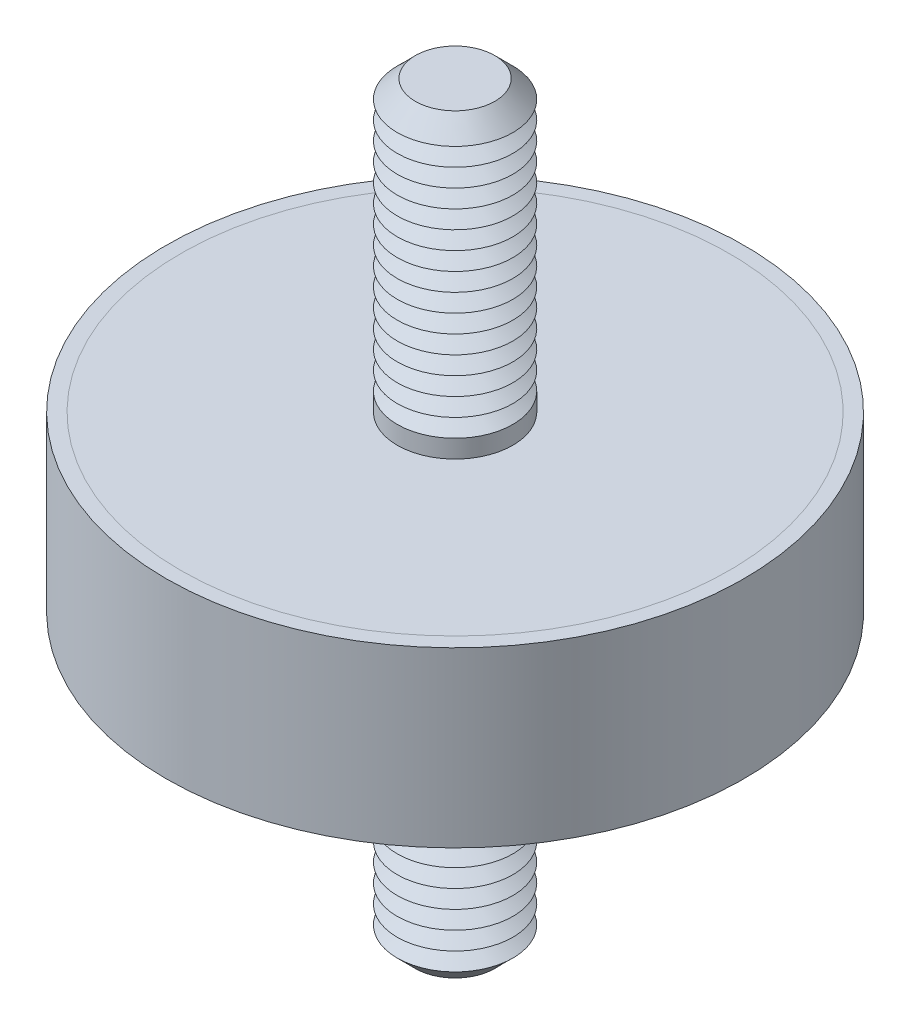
ISO-10303-21;
HEADER;
FILE_DESCRIPTION(('STEP AP214'),'2;1');
FILE_NAME('part.step','',(''),(''),'','','');
FILE_SCHEMA(('AUTOMOTIVE_DESIGN { 1 0 10303 214 1 1 1 1 }'));
ENDSEC;
DATA;
#1=APPLICATION_CONTEXT('core data for automotive mechanical design processes');
#2=APPLICATION_PROTOCOL_DEFINITION('international standard','automotive_design',2000,#1);
#3=PRODUCT_CONTEXT('',#1,'mechanical');
#4=PRODUCT('Part','Part','',(#3));
#5=PRODUCT_RELATED_PRODUCT_CATEGORY('part','',(#4));
#6=PRODUCT_DEFINITION_FORMATION('','',#4);
#7=PRODUCT_DEFINITION_CONTEXT('part definition',#1,'design');
#8=PRODUCT_DEFINITION('design','',#6,#7);
#9=PRODUCT_DEFINITION_SHAPE('','',#8);
#10=(LENGTH_UNIT() NAMED_UNIT(*) SI_UNIT(.MILLI.,.METRE.));
#11=(NAMED_UNIT(*) PLANE_ANGLE_UNIT() SI_UNIT($,.RADIAN.));
#12=(NAMED_UNIT(*) SI_UNIT($,.STERADIAN.) SOLID_ANGLE_UNIT());
#13=UNCERTAINTY_MEASURE_WITH_UNIT(LENGTH_MEASURE(1.E-05),#10,'distance_accuracy_value','');
#14=(GEOMETRIC_REPRESENTATION_CONTEXT(3) GLOBAL_UNCERTAINTY_ASSIGNED_CONTEXT((#13)) GLOBAL_UNIT_ASSIGNED_CONTEXT((#10,
#11,#12)) REPRESENTATION_CONTEXT('',''));
#15=CARTESIAN_POINT('',(0.,0.,0.));
#16=DIRECTION('',(0.,0.,1.));
#17=DIRECTION('',(1.,0.,0.));
#18=AXIS2_PLACEMENT_3D('',#15,#16,#17);
#19=CARTESIAN_POINT('',(0.,-26.,0.));
#20=DIRECTION('',(0.,1.,0.));
#21=DIRECTION('',(0.,0.,1.));
#22=AXIS2_PLACEMENT_3D('',#19,#20,#21);
#23=CYLINDRICAL_SURFACE('',#22,4.);
#24=CARTESIAN_POINT('',(0.,-6.,0.));
#25=DIRECTION('',(0.,-1.,0.));
#26=DIRECTION('',(0.,0.,-1.));
#27=AXIS2_PLACEMENT_3D('',#24,#25,#26);
#28=CIRCLE('',#27,4.);
#29=CARTESIAN_POINT('',(0.,-6.,-4.));
#30=VERTEX_POINT('',#29);
#31=EDGE_CURVE('P0_E21',#30,#30,#28,.T.);
#32=ORIENTED_EDGE('',*,*,#31,.T.);
#33=EDGE_LOOP('',(#32));
#34=FACE_BOUND('',#33,.T.);
#35=CARTESIAN_POINT('',(0.,-7.25,0.));
#36=DIRECTION('',(0.,1.,0.));
#37=DIRECTION('',(0.,0.,1.));
#38=AXIS2_PLACEMENT_3D('',#35,#36,#37);
#39=CIRCLE('',#38,4.);
#40=CARTESIAN_POINT('',(0.,-7.25,4.));
#41=VERTEX_POINT('',#40);
#42=EDGE_CURVE('P0_E33',#41,#41,#39,.T.);
#43=ORIENTED_EDGE('',*,*,#42,.T.);
#44=EDGE_LOOP('',(#43));
#45=FACE_BOUND('',#44,.T.);
#46=ADVANCED_FACE('P0_F14',(#34,#45),#23,.T.);
#47=CARTESIAN_POINT('',(0.,-6.,0.));
#48=DIRECTION('',(0.,1.,0.));
#49=DIRECTION('',(0.,0.,1.));
#50=AXIS2_PLACEMENT_3D('',#47,#48,#49);
#51=CYLINDRICAL_SURFACE('',#50,19.);
#52=CARTESIAN_POINT('',(0.,-6.,0.));
#53=DIRECTION('',(0.,1.,0.));
#54=DIRECTION('',(0.,0.,1.));
#55=AXIS2_PLACEMENT_3D('',#52,#53,#54);
#56=CIRCLE('',#55,19.);
#57=CARTESIAN_POINT('',(0.,-6.,19.));
#58=VERTEX_POINT('',#57);
#59=EDGE_CURVE('P0_E25',#58,#58,#56,.T.);
#60=ORIENTED_EDGE('',*,*,#59,.T.);
#61=EDGE_LOOP('',(#60));
#62=FACE_BOUND('',#61,.T.);
#63=CARTESIAN_POINT('',(0.,-5.5,0.));
#64=DIRECTION('',(0.,1.,0.));
#65=DIRECTION('',(0.,0.,1.));
#66=AXIS2_PLACEMENT_3D('',#63,#64,#65);
#67=CIRCLE('',#66,19.);
#68=CARTESIAN_POINT('',(0.,-5.5,19.));
#69=VERTEX_POINT('',#68);
#70=EDGE_CURVE('P0_E30',#69,#69,#67,.T.);
#71=ORIENTED_EDGE('',*,*,#70,.F.);
#72=EDGE_LOOP('',(#71));
#73=FACE_BOUND('',#72,.T.);
#74=ADVANCED_FACE('P0_F145',(#62,#73),#51,.T.);
#75=CARTESIAN_POINT('',(0.,-6.,0.));
#76=DIRECTION('',(0.,1.,0.));
#77=DIRECTION('',(0.,0.,1.));
#78=AXIS2_PLACEMENT_3D('',#75,#76,#77);
#79=PLANE('',#78);
#80=ORIENTED_EDGE('',*,*,#31,.F.);
#81=EDGE_LOOP('',(#80));
#82=FACE_BOUND('',#81,.T.);
#83=ORIENTED_EDGE('',*,*,#59,.F.);
#84=EDGE_LOOP('',(#83));
#85=FACE_BOUND('',#84,.T.);
#86=ADVANCED_FACE('P0_F150',(#82,#85),#79,.F.);
#87=CARTESIAN_POINT('',(0.,-5.5,0.));
#88=DIRECTION('',(0.,1.,0.));
#89=DIRECTION('',(0.,0.,1.));
#90=AXIS2_PLACEMENT_3D('',#87,#88,#89);
#91=PLANE('',#90);
#92=ORIENTED_EDGE('',*,*,#70,.T.);
#93=EDGE_LOOP('',(#92));
#94=FACE_BOUND('',#93,.T.);
#95=ADVANCED_FACE('P0_F156',(#94),#91,.T.);
#96=CARTESIAN_POINT('',(0.,-7.25,0.));
#97=DIRECTION('',(0.,1.,0.));
#98=DIRECTION('',(0.,0.,1.));
#99=AXIS2_PLACEMENT_3D('',#96,#97,#98);
#100=CONICAL_SURFACE('',#99,4.,1.0471975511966);
#101=CARTESIAN_POINT('',(0.,-7.875,0.));
#102=DIRECTION('',(0.,1.,0.));
#103=DIRECTION('',(0.,0.,1.));
#104=AXIS2_PLACEMENT_3D('',#101,#102,#103);
#105=CIRCLE('',#104,2.91746824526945);
#106=CARTESIAN_POINT('',(0.,-7.875,2.91746824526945));
#107=VERTEX_POINT('',#106);
#108=EDGE_CURVE('P0_E39',#107,#107,#105,.T.);
#109=ORIENTED_EDGE('',*,*,#108,.T.);
#110=EDGE_LOOP('',(#109));
#111=FACE_BOUND('',#110,.T.);
#112=ORIENTED_EDGE('',*,*,#42,.F.);
#113=EDGE_LOOP('',(#112));
#114=FACE_BOUND('',#113,.T.);
#115=ADVANCED_FACE('P0_F159',(#111,#114),#100,.T.);
#116=CARTESIAN_POINT('',(0.,-7.875,0.));
#117=DIRECTION('',(0.,-1.,0.));
#118=DIRECTION('',(0.,0.,-1.));
#119=AXIS2_PLACEMENT_3D('',#116,#117,#118);
#120=CONICAL_SURFACE('',#119,2.91746824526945,1.0471975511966);
#121=CARTESIAN_POINT('',(0.,-8.5,0.));
#122=DIRECTION('',(0.,1.,0.));
#123=DIRECTION('',(0.,0.,1.));
#124=AXIS2_PLACEMENT_3D('',#121,#122,#123);
#125=CIRCLE('',#124,4.);
#126=CARTESIAN_POINT('',(0.,-8.5,4.));
#127=VERTEX_POINT('',#126);
#128=EDGE_CURVE('P0_E43',#127,#127,#125,.T.);
#129=ORIENTED_EDGE('',*,*,#128,.T.);
#130=EDGE_LOOP('',(#129));
#131=FACE_BOUND('',#130,.T.);
#132=ORIENTED_EDGE('',*,*,#108,.F.);
#133=EDGE_LOOP('',(#132));
#134=FACE_BOUND('',#133,.T.);
#135=ADVANCED_FACE('P0_F163',(#131,#134),#120,.T.);
#136=CARTESIAN_POINT('',(0.,-8.5,0.));
#137=DIRECTION('',(0.,1.,0.));
#138=DIRECTION('',(0.,0.,1.));
#139=AXIS2_PLACEMENT_3D('',#136,#137,#138);
#140=CONICAL_SURFACE('',#139,4.,1.0471975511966);
#141=CARTESIAN_POINT('',(0.,-9.125,0.));
#142=DIRECTION('',(0.,1.,0.));
#143=DIRECTION('',(0.,0.,1.));
#144=AXIS2_PLACEMENT_3D('',#141,#142,#143);
#145=CIRCLE('',#144,2.91746824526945);
#146=CARTESIAN_POINT('',(0.,-9.125,2.91746824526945));
#147=VERTEX_POINT('',#146);
#148=EDGE_CURVE('P0_E47',#147,#147,#145,.T.);
#149=ORIENTED_EDGE('',*,*,#148,.T.);
#150=EDGE_LOOP('',(#149));
#151=FACE_BOUND('',#150,.T.);
#152=ORIENTED_EDGE('',*,*,#128,.F.);
#153=EDGE_LOOP('',(#152));
#154=FACE_BOUND('',#153,.T.);
#155=ADVANCED_FACE('P0_F167',(#151,#154),#140,.T.);
#156=CARTESIAN_POINT('',(0.,-9.125,0.));
#157=DIRECTION('',(0.,-1.,0.));
#158=DIRECTION('',(0.,0.,-1.));
#159=AXIS2_PLACEMENT_3D('',#156,#157,#158);
#160=CONICAL_SURFACE('',#159,2.91746824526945,1.0471975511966);
#161=CARTESIAN_POINT('',(0.,-9.75,0.));
#162=DIRECTION('',(0.,1.,0.));
#163=DIRECTION('',(0.,0.,1.));
#164=AXIS2_PLACEMENT_3D('',#161,#162,#163);
#165=CIRCLE('',#164,4.);
#166=CARTESIAN_POINT('',(0.,-9.75,4.));
#167=VERTEX_POINT('',#166);
#168=EDGE_CURVE('P0_E52',#167,#167,#165,.T.);
#169=ORIENTED_EDGE('',*,*,#168,.T.);
#170=EDGE_LOOP('',(#169));
#171=FACE_BOUND('',#170,.T.);
#172=ORIENTED_EDGE('',*,*,#148,.F.);
#173=EDGE_LOOP('',(#172));
#174=FACE_BOUND('',#173,.T.);
#175=ADVANCED_FACE('P0_F174',(#171,#174),#160,.T.);
#176=CARTESIAN_POINT('',(0.,-9.75,0.));
#177=DIRECTION('',(0.,1.,0.));
#178=DIRECTION('',(0.,0.,1.));
#179=AXIS2_PLACEMENT_3D('',#176,#177,#178);
#180=CONICAL_SURFACE('',#179,4.,1.0471975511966);
#181=CARTESIAN_POINT('',(0.,-10.375,0.));
#182=DIRECTION('',(0.,1.,0.));
#183=DIRECTION('',(0.,0.,1.));
#184=AXIS2_PLACEMENT_3D('',#181,#182,#183);
#185=CIRCLE('',#184,2.91746824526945);
#186=CARTESIAN_POINT('',(0.,-10.375,2.91746824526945));
#187=VERTEX_POINT('',#186);
#188=EDGE_CURVE('P0_E55',#187,#187,#185,.T.);
#189=ORIENTED_EDGE('',*,*,#188,.T.);
#190=EDGE_LOOP('',(#189));
#191=FACE_BOUND('',#190,.T.);
#192=ORIENTED_EDGE('',*,*,#168,.F.);
#193=EDGE_LOOP('',(#192));
#194=FACE_BOUND('',#193,.T.);
#195=ADVANCED_FACE('P0_F178',(#191,#194),#180,.T.);
#196=CARTESIAN_POINT('',(0.,-10.375,0.));
#197=DIRECTION('',(0.,-1.,0.));
#198=DIRECTION('',(0.,0.,-1.));
#199=AXIS2_PLACEMENT_3D('',#196,#197,#198);
#200=CONICAL_SURFACE('',#199,2.91746824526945,1.0471975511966);
#201=CARTESIAN_POINT('',(0.,-11.,0.));
#202=DIRECTION('',(0.,1.,0.));
#203=DIRECTION('',(0.,0.,1.));
#204=AXIS2_PLACEMENT_3D('',#201,#202,#203);
#205=CIRCLE('',#204,4.);
#206=CARTESIAN_POINT('',(0.,-11.,4.));
#207=VERTEX_POINT('',#206);
#208=EDGE_CURVE('P0_E58',#207,#207,#205,.T.);
#209=ORIENTED_EDGE('',*,*,#208,.T.);
#210=EDGE_LOOP('',(#209));
#211=FACE_BOUND('',#210,.T.);
#212=ORIENTED_EDGE('',*,*,#188,.F.);
#213=EDGE_LOOP('',(#212));
#214=FACE_BOUND('',#213,.T.);
#215=ADVANCED_FACE('P0_F182',(#211,#214),#200,.T.);
#216=CARTESIAN_POINT('',(0.,-11.,0.));
#217=DIRECTION('',(0.,1.,0.));
#218=DIRECTION('',(0.,0.,1.));
#219=AXIS2_PLACEMENT_3D('',#216,#217,#218);
#220=CONICAL_SURFACE('',#219,4.,1.0471975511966);
#221=CARTESIAN_POINT('',(0.,-11.625,0.));
#222=DIRECTION('',(0.,1.,0.));
#223=DIRECTION('',(0.,0.,1.));
#224=AXIS2_PLACEMENT_3D('',#221,#222,#223);
#225=CIRCLE('',#224,2.91746824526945);
#226=CARTESIAN_POINT('',(0.,-11.625,2.91746824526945));
#227=VERTEX_POINT('',#226);
#228=EDGE_CURVE('P0_E61',#227,#227,#225,.T.);
#229=ORIENTED_EDGE('',*,*,#228,.T.);
#230=EDGE_LOOP('',(#229));
#231=FACE_BOUND('',#230,.T.);
#232=ORIENTED_EDGE('',*,*,#208,.F.);
#233=EDGE_LOOP('',(#232));
#234=FACE_BOUND('',#233,.T.);
#235=ADVANCED_FACE('P0_F186',(#231,#234),#220,.T.);
#236=CARTESIAN_POINT('',(0.,-11.625,0.));
#237=DIRECTION('',(0.,-1.,0.));
#238=DIRECTION('',(0.,0.,-1.));
#239=AXIS2_PLACEMENT_3D('',#236,#237,#238);
#240=CONICAL_SURFACE('',#239,2.91746824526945,1.0471975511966);
#241=CARTESIAN_POINT('',(0.,-12.25,0.));
#242=DIRECTION('',(0.,1.,0.));
#243=DIRECTION('',(0.,0.,1.));
#244=AXIS2_PLACEMENT_3D('',#241,#242,#243);
#245=CIRCLE('',#244,4.);
#246=CARTESIAN_POINT('',(0.,-12.25,4.));
#247=VERTEX_POINT('',#246);
#248=EDGE_CURVE('P0_E64',#247,#247,#245,.T.);
#249=ORIENTED_EDGE('',*,*,#248,.T.);
#250=EDGE_LOOP('',(#249));
#251=FACE_BOUND('',#250,.T.);
#252=ORIENTED_EDGE('',*,*,#228,.F.);
#253=EDGE_LOOP('',(#252));
#254=FACE_BOUND('',#253,.T.);
#255=ADVANCED_FACE('P0_F190',(#251,#254),#240,.T.);
#256=CARTESIAN_POINT('',(0.,-12.25,0.));
#257=DIRECTION('',(0.,1.,0.));
#258=DIRECTION('',(0.,0.,1.));
#259=AXIS2_PLACEMENT_3D('',#256,#257,#258);
#260=CONICAL_SURFACE('',#259,4.,1.0471975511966);
#261=CARTESIAN_POINT('',(0.,-12.875,0.));
#262=DIRECTION('',(0.,1.,0.));
#263=DIRECTION('',(0.,0.,1.));
#264=AXIS2_PLACEMENT_3D('',#261,#262,#263);
#265=CIRCLE('',#264,2.91746824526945);
#266=CARTESIAN_POINT('',(0.,-12.875,2.91746824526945));
#267=VERTEX_POINT('',#266);
#268=EDGE_CURVE('P0_E67',#267,#267,#265,.T.);
#269=ORIENTED_EDGE('',*,*,#268,.T.);
#270=EDGE_LOOP('',(#269));
#271=FACE_BOUND('',#270,.T.);
#272=ORIENTED_EDGE('',*,*,#248,.F.);
#273=EDGE_LOOP('',(#272));
#274=FACE_BOUND('',#273,.T.);
#275=ADVANCED_FACE('P0_F194',(#271,#274),#260,.T.);
#276=CARTESIAN_POINT('',(0.,-12.875,0.));
#277=DIRECTION('',(0.,-1.,0.));
#278=DIRECTION('',(0.,0.,-1.));
#279=AXIS2_PLACEMENT_3D('',#276,#277,#278);
#280=CONICAL_SURFACE('',#279,2.91746824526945,1.0471975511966);
#281=CARTESIAN_POINT('',(0.,-13.5,0.));
#282=DIRECTION('',(0.,1.,0.));
#283=DIRECTION('',(0.,0.,1.));
#284=AXIS2_PLACEMENT_3D('',#281,#282,#283);
#285=CIRCLE('',#284,4.);
#286=CARTESIAN_POINT('',(0.,-13.5,4.));
#287=VERTEX_POINT('',#286);
#288=EDGE_CURVE('P0_E70',#287,#287,#285,.T.);
#289=ORIENTED_EDGE('',*,*,#288,.T.);
#290=EDGE_LOOP('',(#289));
#291=FACE_BOUND('',#290,.T.);
#292=ORIENTED_EDGE('',*,*,#268,.F.);
#293=EDGE_LOOP('',(#292));
#294=FACE_BOUND('',#293,.T.);
#295=ADVANCED_FACE('P0_F198',(#291,#294),#280,.T.);
#296=CARTESIAN_POINT('',(0.,-13.5,0.));
#297=DIRECTION('',(0.,1.,0.));
#298=DIRECTION('',(0.,0.,1.));
#299=AXIS2_PLACEMENT_3D('',#296,#297,#298);
#300=CONICAL_SURFACE('',#299,4.,1.0471975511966);
#301=CARTESIAN_POINT('',(0.,-14.125,0.));
#302=DIRECTION('',(0.,1.,0.));
#303=DIRECTION('',(0.,0.,1.));
#304=AXIS2_PLACEMENT_3D('',#301,#302,#303);
#305=CIRCLE('',#304,2.91746824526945);
#306=CARTESIAN_POINT('',(0.,-14.125,2.91746824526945));
#307=VERTEX_POINT('',#306);
#308=EDGE_CURVE('P0_E73',#307,#307,#305,.T.);
#309=ORIENTED_EDGE('',*,*,#308,.T.);
#310=EDGE_LOOP('',(#309));
#311=FACE_BOUND('',#310,.T.);
#312=ORIENTED_EDGE('',*,*,#288,.F.);
#313=EDGE_LOOP('',(#312));
#314=FACE_BOUND('',#313,.T.);
#315=ADVANCED_FACE('P0_F202',(#311,#314),#300,.T.);
#316=CARTESIAN_POINT('',(0.,-14.125,0.));
#317=DIRECTION('',(0.,-1.,0.));
#318=DIRECTION('',(0.,0.,-1.));
#319=AXIS2_PLACEMENT_3D('',#316,#317,#318);
#320=CONICAL_SURFACE('',#319,2.91746824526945,1.0471975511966);
#321=CARTESIAN_POINT('',(0.,-14.75,0.));
#322=DIRECTION('',(0.,1.,0.));
#323=DIRECTION('',(0.,0.,1.));
#324=AXIS2_PLACEMENT_3D('',#321,#322,#323);
#325=CIRCLE('',#324,4.);
#326=CARTESIAN_POINT('',(0.,-14.75,4.));
#327=VERTEX_POINT('',#326);
#328=EDGE_CURVE('P0_E76',#327,#327,#325,.T.);
#329=ORIENTED_EDGE('',*,*,#328,.T.);
#330=EDGE_LOOP('',(#329));
#331=FACE_BOUND('',#330,.T.);
#332=ORIENTED_EDGE('',*,*,#308,.F.);
#333=EDGE_LOOP('',(#332));
#334=FACE_BOUND('',#333,.T.);
#335=ADVANCED_FACE('P0_F206',(#331,#334),#320,.T.);
#336=CARTESIAN_POINT('',(0.,-14.75,0.));
#337=DIRECTION('',(0.,1.,0.));
#338=DIRECTION('',(0.,0.,1.));
#339=AXIS2_PLACEMENT_3D('',#336,#337,#338);
#340=CONICAL_SURFACE('',#339,4.,1.0471975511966);
#341=CARTESIAN_POINT('',(0.,-15.375,0.));
#342=DIRECTION('',(0.,1.,0.));
#343=DIRECTION('',(0.,0.,1.));
#344=AXIS2_PLACEMENT_3D('',#341,#342,#343);
#345=CIRCLE('',#344,2.91746824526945);
#346=CARTESIAN_POINT('',(0.,-15.375,2.91746824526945));
#347=VERTEX_POINT('',#346);
#348=EDGE_CURVE('P0_E79',#347,#347,#345,.T.);
#349=ORIENTED_EDGE('',*,*,#348,.T.);
#350=EDGE_LOOP('',(#349));
#351=FACE_BOUND('',#350,.T.);
#352=ORIENTED_EDGE('',*,*,#328,.F.);
#353=EDGE_LOOP('',(#352));
#354=FACE_BOUND('',#353,.T.);
#355=ADVANCED_FACE('P0_F210',(#351,#354),#340,.T.);
#356=CARTESIAN_POINT('',(0.,-15.375,0.));
#357=DIRECTION('',(0.,-1.,0.));
#358=DIRECTION('',(0.,0.,-1.));
#359=AXIS2_PLACEMENT_3D('',#356,#357,#358);
#360=CONICAL_SURFACE('',#359,2.91746824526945,1.0471975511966);
#361=CARTESIAN_POINT('',(0.,-16.,0.));
#362=DIRECTION('',(0.,1.,0.));
#363=DIRECTION('',(0.,0.,1.));
#364=AXIS2_PLACEMENT_3D('',#361,#362,#363);
#365=CIRCLE('',#364,4.);
#366=CARTESIAN_POINT('',(0.,-16.,4.));
#367=VERTEX_POINT('',#366);
#368=EDGE_CURVE('P0_E82',#367,#367,#365,.T.);
#369=ORIENTED_EDGE('',*,*,#368,.T.);
#370=EDGE_LOOP('',(#369));
#371=FACE_BOUND('',#370,.T.);
#372=ORIENTED_EDGE('',*,*,#348,.F.);
#373=EDGE_LOOP('',(#372));
#374=FACE_BOUND('',#373,.T.);
#375=ADVANCED_FACE('P0_F214',(#371,#374),#360,.T.);
#376=CARTESIAN_POINT('',(0.,-16.,0.));
#377=DIRECTION('',(0.,1.,0.));
#378=DIRECTION('',(0.,0.,1.));
#379=AXIS2_PLACEMENT_3D('',#376,#377,#378);
#380=CONICAL_SURFACE('',#379,4.,1.0471975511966);
#381=CARTESIAN_POINT('',(0.,-16.625,0.));
#382=DIRECTION('',(0.,1.,0.));
#383=DIRECTION('',(0.,0.,1.));
#384=AXIS2_PLACEMENT_3D('',#381,#382,#383);
#385=CIRCLE('',#384,2.91746824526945);
#386=CARTESIAN_POINT('',(0.,-16.625,2.91746824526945));
#387=VERTEX_POINT('',#386);
#388=EDGE_CURVE('P0_E85',#387,#387,#385,.T.);
#389=ORIENTED_EDGE('',*,*,#388,.T.);
#390=EDGE_LOOP('',(#389));
#391=FACE_BOUND('',#390,.T.);
#392=ORIENTED_EDGE('',*,*,#368,.F.);
#393=EDGE_LOOP('',(#392));
#394=FACE_BOUND('',#393,.T.);
#395=ADVANCED_FACE('P0_F218',(#391,#394),#380,.T.);
#396=CARTESIAN_POINT('',(0.,-16.625,0.));
#397=DIRECTION('',(0.,-1.,0.));
#398=DIRECTION('',(0.,0.,-1.));
#399=AXIS2_PLACEMENT_3D('',#396,#397,#398);
#400=CONICAL_SURFACE('',#399,2.91746824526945,1.0471975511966);
#401=CARTESIAN_POINT('',(0.,-17.25,0.));
#402=DIRECTION('',(0.,1.,0.));
#403=DIRECTION('',(0.,0.,1.));
#404=AXIS2_PLACEMENT_3D('',#401,#402,#403);
#405=CIRCLE('',#404,4.);
#406=CARTESIAN_POINT('',(0.,-17.25,4.));
#407=VERTEX_POINT('',#406);
#408=EDGE_CURVE('P0_E88',#407,#407,#405,.T.);
#409=ORIENTED_EDGE('',*,*,#408,.T.);
#410=EDGE_LOOP('',(#409));
#411=FACE_BOUND('',#410,.T.);
#412=ORIENTED_EDGE('',*,*,#388,.F.);
#413=EDGE_LOOP('',(#412));
#414=FACE_BOUND('',#413,.T.);
#415=ADVANCED_FACE('P0_F222',(#411,#414),#400,.T.);
#416=CARTESIAN_POINT('',(0.,-17.25,0.));
#417=DIRECTION('',(0.,1.,0.));
#418=DIRECTION('',(0.,0.,1.));
#419=AXIS2_PLACEMENT_3D('',#416,#417,#418);
#420=CONICAL_SURFACE('',#419,4.,1.0471975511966);
#421=CARTESIAN_POINT('',(0.,-17.875,0.));
#422=DIRECTION('',(0.,1.,0.));
#423=DIRECTION('',(0.,0.,1.));
#424=AXIS2_PLACEMENT_3D('',#421,#422,#423);
#425=CIRCLE('',#424,2.91746824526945);
#426=CARTESIAN_POINT('',(0.,-17.875,2.91746824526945));
#427=VERTEX_POINT('',#426);
#428=EDGE_CURVE('P0_E91',#427,#427,#425,.T.);
#429=ORIENTED_EDGE('',*,*,#428,.T.);
#430=EDGE_LOOP('',(#429));
#431=FACE_BOUND('',#430,.T.);
#432=ORIENTED_EDGE('',*,*,#408,.F.);
#433=EDGE_LOOP('',(#432));
#434=FACE_BOUND('',#433,.T.);
#435=ADVANCED_FACE('P0_F226',(#431,#434),#420,.T.);
#436=CARTESIAN_POINT('',(0.,-17.875,0.));
#437=DIRECTION('',(0.,-1.,0.));
#438=DIRECTION('',(0.,0.,-1.));
#439=AXIS2_PLACEMENT_3D('',#436,#437,#438);
#440=CONICAL_SURFACE('',#439,2.91746824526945,1.0471975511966);
#441=CARTESIAN_POINT('',(0.,-18.5,0.));
#442=DIRECTION('',(0.,1.,0.));
#443=DIRECTION('',(0.,0.,1.));
#444=AXIS2_PLACEMENT_3D('',#441,#442,#443);
#445=CIRCLE('',#444,4.);
#446=CARTESIAN_POINT('',(0.,-18.5,4.));
#447=VERTEX_POINT('',#446);
#448=EDGE_CURVE('P0_E94',#447,#447,#445,.T.);
#449=ORIENTED_EDGE('',*,*,#448,.T.);
#450=EDGE_LOOP('',(#449));
#451=FACE_BOUND('',#450,.T.);
#452=ORIENTED_EDGE('',*,*,#428,.F.);
#453=EDGE_LOOP('',(#452));
#454=FACE_BOUND('',#453,.T.);
#455=ADVANCED_FACE('P0_F230',(#451,#454),#440,.T.);
#456=CARTESIAN_POINT('',(0.,-18.5,0.));
#457=DIRECTION('',(0.,1.,0.));
#458=DIRECTION('',(0.,0.,1.));
#459=AXIS2_PLACEMENT_3D('',#456,#457,#458);
#460=CONICAL_SURFACE('',#459,4.,1.0471975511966);
#461=CARTESIAN_POINT('',(0.,-19.125,0.));
#462=DIRECTION('',(0.,1.,0.));
#463=DIRECTION('',(0.,0.,1.));
#464=AXIS2_PLACEMENT_3D('',#461,#462,#463);
#465=CIRCLE('',#464,2.91746824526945);
#466=CARTESIAN_POINT('',(0.,-19.125,2.91746824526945));
#467=VERTEX_POINT('',#466);
#468=EDGE_CURVE('P0_E97',#467,#467,#465,.T.);
#469=ORIENTED_EDGE('',*,*,#468,.T.);
#470=EDGE_LOOP('',(#469));
#471=FACE_BOUND('',#470,.T.);
#472=ORIENTED_EDGE('',*,*,#448,.F.);
#473=EDGE_LOOP('',(#472));
#474=FACE_BOUND('',#473,.T.);
#475=ADVANCED_FACE('P0_F234',(#471,#474),#460,.T.);
#476=CARTESIAN_POINT('',(0.,-19.125,0.));
#477=DIRECTION('',(0.,-1.,0.));
#478=DIRECTION('',(0.,0.,-1.));
#479=AXIS2_PLACEMENT_3D('',#476,#477,#478);
#480=CONICAL_SURFACE('',#479,2.91746824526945,1.0471975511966);
#481=CARTESIAN_POINT('',(0.,-19.75,0.));
#482=DIRECTION('',(0.,1.,0.));
#483=DIRECTION('',(0.,0.,1.));
#484=AXIS2_PLACEMENT_3D('',#481,#482,#483);
#485=CIRCLE('',#484,4.);
#486=CARTESIAN_POINT('',(0.,-19.75,4.));
#487=VERTEX_POINT('',#486);
#488=EDGE_CURVE('P0_E100',#487,#487,#485,.T.);
#489=ORIENTED_EDGE('',*,*,#488,.T.);
#490=EDGE_LOOP('',(#489));
#491=FACE_BOUND('',#490,.T.);
#492=ORIENTED_EDGE('',*,*,#468,.F.);
#493=EDGE_LOOP('',(#492));
#494=FACE_BOUND('',#493,.T.);
#495=ADVANCED_FACE('P0_F238',(#491,#494),#480,.T.);
#496=CARTESIAN_POINT('',(0.,-19.75,0.));
#497=DIRECTION('',(0.,1.,0.));
#498=DIRECTION('',(0.,0.,1.));
#499=AXIS2_PLACEMENT_3D('',#496,#497,#498);
#500=CONICAL_SURFACE('',#499,4.,1.0471975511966);
#501=CARTESIAN_POINT('',(0.,-20.375,0.));
#502=DIRECTION('',(0.,1.,0.));
#503=DIRECTION('',(0.,0.,1.));
#504=AXIS2_PLACEMENT_3D('',#501,#502,#503);
#505=CIRCLE('',#504,2.91746824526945);
#506=CARTESIAN_POINT('',(0.,-20.375,2.91746824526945));
#507=VERTEX_POINT('',#506);
#508=EDGE_CURVE('P0_E103',#507,#507,#505,.T.);
#509=ORIENTED_EDGE('',*,*,#508,.T.);
#510=EDGE_LOOP('',(#509));
#511=FACE_BOUND('',#510,.T.);
#512=ORIENTED_EDGE('',*,*,#488,.F.);
#513=EDGE_LOOP('',(#512));
#514=FACE_BOUND('',#513,.T.);
#515=ADVANCED_FACE('P0_F242',(#511,#514),#500,.T.);
#516=CARTESIAN_POINT('',(0.,-20.375,0.));
#517=DIRECTION('',(0.,-1.,0.));
#518=DIRECTION('',(0.,0.,-1.));
#519=AXIS2_PLACEMENT_3D('',#516,#517,#518);
#520=CONICAL_SURFACE('',#519,2.91746824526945,1.0471975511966);
#521=CARTESIAN_POINT('',(0.,-21.,0.));
#522=DIRECTION('',(0.,1.,0.));
#523=DIRECTION('',(0.,0.,1.));
#524=AXIS2_PLACEMENT_3D('',#521,#522,#523);
#525=CIRCLE('',#524,4.);
#526=CARTESIAN_POINT('',(0.,-21.,4.));
#527=VERTEX_POINT('',#526);
#528=EDGE_CURVE('P0_E106',#527,#527,#525,.T.);
#529=ORIENTED_EDGE('',*,*,#528,.T.);
#530=EDGE_LOOP('',(#529));
#531=FACE_BOUND('',#530,.T.);
#532=ORIENTED_EDGE('',*,*,#508,.F.);
#533=EDGE_LOOP('',(#532));
#534=FACE_BOUND('',#533,.T.);
#535=ADVANCED_FACE('P0_F246',(#531,#534),#520,.T.);
#536=CARTESIAN_POINT('',(0.,-21.,0.));
#537=DIRECTION('',(0.,1.,0.));
#538=DIRECTION('',(0.,0.,1.));
#539=AXIS2_PLACEMENT_3D('',#536,#537,#538);
#540=CONICAL_SURFACE('',#539,4.,1.0471975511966);
#541=CARTESIAN_POINT('',(0.,-21.625,0.));
#542=DIRECTION('',(0.,1.,0.));
#543=DIRECTION('',(0.,0.,1.));
#544=AXIS2_PLACEMENT_3D('',#541,#542,#543);
#545=CIRCLE('',#544,2.91746824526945);
#546=CARTESIAN_POINT('',(0.,-21.625,2.91746824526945));
#547=VERTEX_POINT('',#546);
#548=EDGE_CURVE('P0_E109',#547,#547,#545,.T.);
#549=ORIENTED_EDGE('',*,*,#548,.T.);
#550=EDGE_LOOP('',(#549));
#551=FACE_BOUND('',#550,.T.);
#552=ORIENTED_EDGE('',*,*,#528,.F.);
#553=EDGE_LOOP('',(#552));
#554=FACE_BOUND('',#553,.T.);
#555=ADVANCED_FACE('P0_F250',(#551,#554),#540,.T.);
#556=CARTESIAN_POINT('',(0.,-21.625,0.));
#557=DIRECTION('',(0.,-1.,0.));
#558=DIRECTION('',(0.,0.,-1.));
#559=AXIS2_PLACEMENT_3D('',#556,#557,#558);
#560=CONICAL_SURFACE('',#559,2.91746824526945,1.0471975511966);
#561=CARTESIAN_POINT('',(0.,-22.25,0.));
#562=DIRECTION('',(0.,1.,0.));
#563=DIRECTION('',(0.,0.,1.));
#564=AXIS2_PLACEMENT_3D('',#561,#562,#563);
#565=CIRCLE('',#564,4.);
#566=CARTESIAN_POINT('',(0.,-22.25,4.));
#567=VERTEX_POINT('',#566);
#568=EDGE_CURVE('P0_E112',#567,#567,#565,.T.);
#569=ORIENTED_EDGE('',*,*,#568,.T.);
#570=EDGE_LOOP('',(#569));
#571=FACE_BOUND('',#570,.T.);
#572=ORIENTED_EDGE('',*,*,#548,.F.);
#573=EDGE_LOOP('',(#572));
#574=FACE_BOUND('',#573,.T.);
#575=ADVANCED_FACE('P0_F254',(#571,#574),#560,.T.);
#576=CARTESIAN_POINT('',(0.,-22.25,0.));
#577=DIRECTION('',(0.,1.,0.));
#578=DIRECTION('',(0.,0.,1.));
#579=AXIS2_PLACEMENT_3D('',#576,#577,#578);
#580=CONICAL_SURFACE('',#579,4.,1.0471975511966);
#581=CARTESIAN_POINT('',(0.,-22.875,0.));
#582=DIRECTION('',(0.,1.,0.));
#583=DIRECTION('',(0.,0.,1.));
#584=AXIS2_PLACEMENT_3D('',#581,#582,#583);
#585=CIRCLE('',#584,2.91746824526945);
#586=CARTESIAN_POINT('',(0.,-22.875,2.91746824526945));
#587=VERTEX_POINT('',#586);
#588=EDGE_CURVE('P0_E115',#587,#587,#585,.T.);
#589=ORIENTED_EDGE('',*,*,#588,.T.);
#590=EDGE_LOOP('',(#589));
#591=FACE_BOUND('',#590,.T.);
#592=ORIENTED_EDGE('',*,*,#568,.F.);
#593=EDGE_LOOP('',(#592));
#594=FACE_BOUND('',#593,.T.);
#595=ADVANCED_FACE('P0_F258',(#591,#594),#580,.T.);
#596=CARTESIAN_POINT('',(0.,-22.875,0.));
#597=DIRECTION('',(0.,-1.,0.));
#598=DIRECTION('',(0.,0.,-1.));
#599=AXIS2_PLACEMENT_3D('',#596,#597,#598);
#600=CONICAL_SURFACE('',#599,2.91746824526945,1.0471975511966);
#601=CARTESIAN_POINT('',(0.,-23.5,0.));
#602=DIRECTION('',(0.,1.,0.));
#603=DIRECTION('',(0.,0.,1.));
#604=AXIS2_PLACEMENT_3D('',#601,#602,#603);
#605=CIRCLE('',#604,4.);
#606=CARTESIAN_POINT('',(0.,-23.5,4.));
#607=VERTEX_POINT('',#606);
#608=EDGE_CURVE('P0_E118',#607,#607,#605,.T.);
#609=ORIENTED_EDGE('',*,*,#608,.T.);
#610=EDGE_LOOP('',(#609));
#611=FACE_BOUND('',#610,.T.);
#612=ORIENTED_EDGE('',*,*,#588,.F.);
#613=EDGE_LOOP('',(#612));
#614=FACE_BOUND('',#613,.T.);
#615=ADVANCED_FACE('P0_F142',(#611,#614),#600,.T.);
#616=CARTESIAN_POINT('',(0.,-23.5,0.));
#617=DIRECTION('',(0.,1.,0.));
#618=DIRECTION('',(0.,0.,1.));
#619=AXIS2_PLACEMENT_3D('',#616,#617,#618);
#620=CONICAL_SURFACE('',#619,4.,1.0471975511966);
#621=CARTESIAN_POINT('',(0.,-24.125,0.));
#622=DIRECTION('',(0.,1.,0.));
#623=DIRECTION('',(0.,0.,1.));
#624=AXIS2_PLACEMENT_3D('',#621,#622,#623);
#625=CIRCLE('',#624,2.91746824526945);
#626=CARTESIAN_POINT('',(0.,-24.125,2.91746824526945));
#627=VERTEX_POINT('',#626);
#628=EDGE_CURVE('P0_E124',#627,#627,#625,.T.);
#629=ORIENTED_EDGE('',*,*,#628,.T.);
#630=EDGE_LOOP('',(#629));
#631=FACE_BOUND('',#630,.T.);
#632=ORIENTED_EDGE('',*,*,#608,.F.);
#633=EDGE_LOOP('',(#632));
#634=FACE_BOUND('',#633,.T.);
#635=ADVANCED_FACE('P0_F128',(#631,#634),#620,.T.);
#636=CARTESIAN_POINT('',(0.,-24.125,0.));
#637=DIRECTION('',(0.,-1.,0.));
#638=DIRECTION('',(0.,0.,-1.));
#639=AXIS2_PLACEMENT_3D('',#636,#637,#638);
#640=CONICAL_SURFACE('',#639,2.91746824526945,1.0471975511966);
#641=CARTESIAN_POINT('',(0.,-24.75,0.));
#642=DIRECTION('',(0.,1.,0.));
#643=DIRECTION('',(0.,0.,1.));
#644=AXIS2_PLACEMENT_3D('',#641,#642,#643);
#645=CIRCLE('',#644,4.);
#646=CARTESIAN_POINT('',(0.,-24.75,4.));
#647=VERTEX_POINT('',#646);
#648=EDGE_CURVE('P0_E121',#647,#647,#645,.T.);
#649=ORIENTED_EDGE('',*,*,#648,.T.);
#650=EDGE_LOOP('',(#649));
#651=FACE_BOUND('',#650,.T.);
#652=ORIENTED_EDGE('',*,*,#628,.F.);
#653=EDGE_LOOP('',(#652));
#654=FACE_BOUND('',#653,.T.);
#655=ADVANCED_FACE('P0_F131',(#651,#654),#640,.T.);
#656=CARTESIAN_POINT('',(0.,-26.,0.));
#657=DIRECTION('',(0.,-1.,0.));
#658=DIRECTION('',(0.,0.,-1.));
#659=AXIS2_PLACEMENT_3D('',#656,#657,#658);
#660=PLANE('',#659);
#661=CARTESIAN_POINT('',(0.,-26.,0.));
#662=DIRECTION('',(0.,-1.,0.));
#663=DIRECTION('',(0.,0.,-1.));
#664=AXIS2_PLACEMENT_3D('',#661,#662,#663);
#665=CIRCLE('',#664,2.75000000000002);
#666=CARTESIAN_POINT('',(0.,-26.,-2.75000000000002));
#667=VERTEX_POINT('',#666);
#668=EDGE_CURVE('P0_E10',#667,#667,#665,.T.);
#669=ORIENTED_EDGE('',*,*,#668,.T.);
#670=EDGE_LOOP('',(#669));
#671=FACE_BOUND('',#670,.T.);
#672=ADVANCED_FACE('P0_F133',(#671),#660,.T.);
#673=CARTESIAN_POINT('',(0.,-26.,0.));
#674=DIRECTION('',(0.,1.,0.));
#675=DIRECTION('',(0.,0.,1.));
#676=AXIS2_PLACEMENT_3D('',#673,#674,#675);
#677=CONICAL_SURFACE('',#676,2.75000000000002,0.785398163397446);
#678=ORIENTED_EDGE('',*,*,#648,.F.);
#679=EDGE_LOOP('',(#678));
#680=FACE_BOUND('',#679,.T.);
#681=ORIENTED_EDGE('',*,*,#668,.F.);
#682=EDGE_LOOP('',(#681));
#683=FACE_BOUND('',#682,.T.);
#684=ADVANCED_FACE('P0_F16',(#680,#683),#677,.T.);
#685=CLOSED_SHELL('',(#46,#74,#86,#95,#115,#135,#155,#175,#195,#215,#235,#255,#275,#295,#315,
#335,#355,#375,#395,#415,#435,#455,#475,#495,#515,#535,#555,#575,#595,#615,#635,#655,#672,#684));
#686=MANIFOLD_SOLID_BREP('P0_B1',#685);
#687=CARTESIAN_POINT('',(0.,26.,0.));
#688=DIRECTION('',(0.,-1.,0.));
#689=DIRECTION('',(0.,0.,-1.));
#690=AXIS2_PLACEMENT_3D('',#687,#688,#689);
#691=CYLINDRICAL_SURFACE('',#690,4.);
#692=CARTESIAN_POINT('',(0.,7.25,0.));
#693=DIRECTION('',(0.,1.,0.));
#694=DIRECTION('',(0.,0.,1.));
#695=AXIS2_PLACEMENT_3D('',#692,#693,#694);
#696=CIRCLE('',#695,4.);
#697=CARTESIAN_POINT('',(0.,7.25,4.));
#698=VERTEX_POINT('',#697);
#699=EDGE_CURVE('P1_E33',#698,#698,#696,.T.);
#700=ORIENTED_EDGE('',*,*,#699,.F.);
#701=EDGE_LOOP('',(#700));
#702=FACE_BOUND('',#701,.T.);
#703=CARTESIAN_POINT('',(0.,6.,0.));
#704=DIRECTION('',(0.,1.,0.));
#705=DIRECTION('',(0.,0.,1.));
#706=AXIS2_PLACEMENT_3D('',#703,#704,#705);
#707=CIRCLE('',#706,4.);
#708=CARTESIAN_POINT('',(0.,6.,4.));
#709=VERTEX_POINT('',#708);
#710=EDGE_CURVE('P1_E21',#709,#709,#707,.T.);
#711=ORIENTED_EDGE('',*,*,#710,.T.);
#712=EDGE_LOOP('',(#711));
#713=FACE_BOUND('',#712,.T.);
#714=ADVANCED_FACE('P1_F14',(#702,#713),#691,.T.);
#715=CARTESIAN_POINT('',(0.,6.,0.));
#716=DIRECTION('',(0.,-1.,0.));
#717=DIRECTION('',(0.,0.,-1.));
#718=AXIS2_PLACEMENT_3D('',#715,#716,#717);
#719=CYLINDRICAL_SURFACE('',#718,19.);
#720=CARTESIAN_POINT('',(0.,6.,0.));
#721=DIRECTION('',(0.,1.,0.));
#722=DIRECTION('',(0.,0.,1.));
#723=AXIS2_PLACEMENT_3D('',#720,#721,#722);
#724=CIRCLE('',#723,19.);
#725=CARTESIAN_POINT('',(0.,6.,19.));
#726=VERTEX_POINT('',#725);
#727=EDGE_CURVE('P1_E25',#726,#726,#724,.T.);
#728=ORIENTED_EDGE('',*,*,#727,.F.);
#729=EDGE_LOOP('',(#728));
#730=FACE_BOUND('',#729,.T.);
#731=CARTESIAN_POINT('',(0.,5.5,0.));
#732=DIRECTION('',(0.,1.,0.));
#733=DIRECTION('',(0.,0.,1.));
#734=AXIS2_PLACEMENT_3D('',#731,#732,#733);
#735=CIRCLE('',#734,19.);
#736=CARTESIAN_POINT('',(0.,5.5,19.));
#737=VERTEX_POINT('',#736);
#738=EDGE_CURVE('P1_E30',#737,#737,#735,.T.);
#739=ORIENTED_EDGE('',*,*,#738,.T.);
#740=EDGE_LOOP('',(#739));
#741=FACE_BOUND('',#740,.T.);
#742=ADVANCED_FACE('P1_F292',(#730,#741),#719,.T.);
#743=CARTESIAN_POINT('',(0.,6.,0.));
#744=DIRECTION('',(0.,1.,0.));
#745=DIRECTION('',(0.,0.,1.));
#746=AXIS2_PLACEMENT_3D('',#743,#744,#745);
#747=PLANE('',#746);
#748=ORIENTED_EDGE('',*,*,#710,.F.);
#749=EDGE_LOOP('',(#748));
#750=FACE_BOUND('',#749,.T.);
#751=ORIENTED_EDGE('',*,*,#727,.T.);
#752=EDGE_LOOP('',(#751));
#753=FACE_BOUND('',#752,.T.);
#754=ADVANCED_FACE('P1_F298',(#750,#753),#747,.T.);
#755=CARTESIAN_POINT('',(0.,5.5,0.));
#756=DIRECTION('',(0.,1.,0.));
#757=DIRECTION('',(0.,0.,1.));
#758=AXIS2_PLACEMENT_3D('',#755,#756,#757);
#759=PLANE('',#758);
#760=ORIENTED_EDGE('',*,*,#738,.F.);
#761=EDGE_LOOP('',(#760));
#762=FACE_BOUND('',#761,.T.);
#763=ADVANCED_FACE('P1_F288',(#762),#759,.F.);
#764=CARTESIAN_POINT('',(0.,7.25,0.));
#765=DIRECTION('',(0.,-1.,0.));
#766=DIRECTION('',(0.,0.,-1.));
#767=AXIS2_PLACEMENT_3D('',#764,#765,#766);
#768=CONICAL_SURFACE('',#767,4.,1.0471975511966);
#769=CARTESIAN_POINT('',(0.,7.875,0.));
#770=DIRECTION('',(0.,1.,0.));
#771=DIRECTION('',(0.,0.,1.));
#772=AXIS2_PLACEMENT_3D('',#769,#770,#771);
#773=CIRCLE('',#772,2.91746824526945);
#774=CARTESIAN_POINT('',(0.,7.875,2.91746824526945));
#775=VERTEX_POINT('',#774);
#776=EDGE_CURVE('P1_E39',#775,#775,#773,.T.);
#777=ORIENTED_EDGE('',*,*,#776,.F.);
#778=EDGE_LOOP('',(#777));
#779=FACE_BOUND('',#778,.T.);
#780=ORIENTED_EDGE('',*,*,#699,.T.);
#781=EDGE_LOOP('',(#780));
#782=FACE_BOUND('',#781,.T.);
#783=ADVANCED_FACE('P1_F282',(#779,#782),#768,.T.);
#784=CARTESIAN_POINT('',(0.,7.875,0.));
#785=DIRECTION('',(0.,1.,0.));
#786=DIRECTION('',(0.,0.,1.));
#787=AXIS2_PLACEMENT_3D('',#784,#785,#786);
#788=CONICAL_SURFACE('',#787,2.91746824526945,1.0471975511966);
#789=CARTESIAN_POINT('',(0.,8.5,0.));
#790=DIRECTION('',(0.,1.,0.));
#791=DIRECTION('',(0.,0.,1.));
#792=AXIS2_PLACEMENT_3D('',#789,#790,#791);
#793=CIRCLE('',#792,4.);
#794=CARTESIAN_POINT('',(0.,8.5,4.));
#795=VERTEX_POINT('',#794);
#796=EDGE_CURVE('P1_E43',#795,#795,#793,.T.);
#797=ORIENTED_EDGE('',*,*,#796,.F.);
#798=EDGE_LOOP('',(#797));
#799=FACE_BOUND('',#798,.T.);
#800=ORIENTED_EDGE('',*,*,#776,.T.);
#801=EDGE_LOOP('',(#800));
#802=FACE_BOUND('',#801,.T.);
#803=ADVANCED_FACE('P1_F277',(#799,#802),#788,.T.);
#804=CARTESIAN_POINT('',(0.,8.5,0.));
#805=DIRECTION('',(0.,-1.,0.));
#806=DIRECTION('',(0.,0.,-1.));
#807=AXIS2_PLACEMENT_3D('',#804,#805,#806);
#808=CONICAL_SURFACE('',#807,4.,1.0471975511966);
#809=CARTESIAN_POINT('',(0.,9.125,0.));
#810=DIRECTION('',(0.,1.,0.));
#811=DIRECTION('',(0.,0.,1.));
#812=AXIS2_PLACEMENT_3D('',#809,#810,#811);
#813=CIRCLE('',#812,2.91746824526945);
#814=CARTESIAN_POINT('',(0.,9.125,2.91746824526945));
#815=VERTEX_POINT('',#814);
#816=EDGE_CURVE('P1_E47',#815,#815,#813,.T.);
#817=ORIENTED_EDGE('',*,*,#816,.F.);
#818=EDGE_LOOP('',(#817));
#819=FACE_BOUND('',#818,.T.);
#820=ORIENTED_EDGE('',*,*,#796,.T.);
#821=EDGE_LOOP('',(#820));
#822=FACE_BOUND('',#821,.T.);
#823=ADVANCED_FACE('P1_F271',(#819,#822),#808,.T.);
#824=CARTESIAN_POINT('',(0.,9.125,0.));
#825=DIRECTION('',(0.,1.,0.));
#826=DIRECTION('',(0.,0.,1.));
#827=AXIS2_PLACEMENT_3D('',#824,#825,#826);
#828=CONICAL_SURFACE('',#827,2.91746824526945,1.0471975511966);
#829=CARTESIAN_POINT('',(0.,9.75,0.));
#830=DIRECTION('',(0.,1.,0.));
#831=DIRECTION('',(0.,0.,1.));
#832=AXIS2_PLACEMENT_3D('',#829,#830,#831);
#833=CIRCLE('',#832,4.);
#834=CARTESIAN_POINT('',(0.,9.75,4.));
#835=VERTEX_POINT('',#834);
#836=EDGE_CURVE('P1_E52',#835,#835,#833,.T.);
#837=ORIENTED_EDGE('',*,*,#836,.F.);
#838=EDGE_LOOP('',(#837));
#839=FACE_BOUND('',#838,.T.);
#840=ORIENTED_EDGE('',*,*,#816,.T.);
#841=EDGE_LOOP('',(#840));
#842=FACE_BOUND('',#841,.T.);
#843=ADVANCED_FACE('P1_F265',(#839,#842),#828,.T.);
#844=CARTESIAN_POINT('',(0.,9.75,0.));
#845=DIRECTION('',(0.,-1.,0.));
#846=DIRECTION('',(0.,0.,-1.));
#847=AXIS2_PLACEMENT_3D('',#844,#845,#846);
#848=CONICAL_SURFACE('',#847,4.,1.0471975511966);
#849=CARTESIAN_POINT('',(0.,10.375,0.));
#850=DIRECTION('',(0.,1.,0.));
#851=DIRECTION('',(0.,0.,1.));
#852=AXIS2_PLACEMENT_3D('',#849,#850,#851);
#853=CIRCLE('',#852,2.91746824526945);
#854=CARTESIAN_POINT('',(0.,10.375,2.91746824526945));
#855=VERTEX_POINT('',#854);
#856=EDGE_CURVE('P1_E55',#855,#855,#853,.T.);
#857=ORIENTED_EDGE('',*,*,#856,.F.);
#858=EDGE_LOOP('',(#857));
#859=FACE_BOUND('',#858,.T.);
#860=ORIENTED_EDGE('',*,*,#836,.T.);
#861=EDGE_LOOP('',(#860));
#862=FACE_BOUND('',#861,.T.);
#863=ADVANCED_FACE('P1_F259',(#859,#862),#848,.T.);
#864=CARTESIAN_POINT('',(0.,10.375,0.));
#865=DIRECTION('',(0.,1.,0.));
#866=DIRECTION('',(0.,0.,1.));
#867=AXIS2_PLACEMENT_3D('',#864,#865,#866);
#868=CONICAL_SURFACE('',#867,2.91746824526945,1.0471975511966);
#869=CARTESIAN_POINT('',(0.,11.,0.));
#870=DIRECTION('',(0.,1.,0.));
#871=DIRECTION('',(0.,0.,1.));
#872=AXIS2_PLACEMENT_3D('',#869,#870,#871);
#873=CIRCLE('',#872,4.);
#874=CARTESIAN_POINT('',(0.,11.,4.));
#875=VERTEX_POINT('',#874);
#876=EDGE_CURVE('P1_E58',#875,#875,#873,.T.);
#877=ORIENTED_EDGE('',*,*,#876,.F.);
#878=EDGE_LOOP('',(#877));
#879=FACE_BOUND('',#878,.T.);
#880=ORIENTED_EDGE('',*,*,#856,.T.);
#881=EDGE_LOOP('',(#880));
#882=FACE_BOUND('',#881,.T.);
#883=ADVANCED_FACE('P1_F253',(#879,#882),#868,.T.);
#884=CARTESIAN_POINT('',(0.,11.,0.));
#885=DIRECTION('',(0.,-1.,0.));
#886=DIRECTION('',(0.,0.,-1.));
#887=AXIS2_PLACEMENT_3D('',#884,#885,#886);
#888=CONICAL_SURFACE('',#887,4.,1.0471975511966);
#889=CARTESIAN_POINT('',(0.,11.625,0.));
#890=DIRECTION('',(0.,1.,0.));
#891=DIRECTION('',(0.,0.,1.));
#892=AXIS2_PLACEMENT_3D('',#889,#890,#891);
#893=CIRCLE('',#892,2.91746824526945);
#894=CARTESIAN_POINT('',(0.,11.625,2.91746824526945));
#895=VERTEX_POINT('',#894);
#896=EDGE_CURVE('P1_E61',#895,#895,#893,.T.);
#897=ORIENTED_EDGE('',*,*,#896,.F.);
#898=EDGE_LOOP('',(#897));
#899=FACE_BOUND('',#898,.T.);
#900=ORIENTED_EDGE('',*,*,#876,.T.);
#901=EDGE_LOOP('',(#900));
#902=FACE_BOUND('',#901,.T.);
#903=ADVANCED_FACE('P1_F247',(#899,#902),#888,.T.);
#904=CARTESIAN_POINT('',(0.,11.625,0.));
#905=DIRECTION('',(0.,1.,0.));
#906=DIRECTION('',(0.,0.,1.));
#907=AXIS2_PLACEMENT_3D('',#904,#905,#906);
#908=CONICAL_SURFACE('',#907,2.91746824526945,1.0471975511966);
#909=CARTESIAN_POINT('',(0.,12.25,0.));
#910=DIRECTION('',(0.,1.,0.));
#911=DIRECTION('',(0.,0.,1.));
#912=AXIS2_PLACEMENT_3D('',#909,#910,#911);
#913=CIRCLE('',#912,4.);
#914=CARTESIAN_POINT('',(0.,12.25,4.));
#915=VERTEX_POINT('',#914);
#916=EDGE_CURVE('P1_E64',#915,#915,#913,.T.);
#917=ORIENTED_EDGE('',*,*,#916,.F.);
#918=EDGE_LOOP('',(#917));
#919=FACE_BOUND('',#918,.T.);
#920=ORIENTED_EDGE('',*,*,#896,.T.);
#921=EDGE_LOOP('',(#920));
#922=FACE_BOUND('',#921,.T.);
#923=ADVANCED_FACE('P1_F241',(#919,#922),#908,.T.);
#924=CARTESIAN_POINT('',(0.,12.25,0.));
#925=DIRECTION('',(0.,-1.,0.));
#926=DIRECTION('',(0.,0.,-1.));
#927=AXIS2_PLACEMENT_3D('',#924,#925,#926);
#928=CONICAL_SURFACE('',#927,4.,1.0471975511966);
#929=CARTESIAN_POINT('',(0.,12.875,0.));
#930=DIRECTION('',(0.,1.,0.));
#931=DIRECTION('',(0.,0.,1.));
#932=AXIS2_PLACEMENT_3D('',#929,#930,#931);
#933=CIRCLE('',#932,2.91746824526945);
#934=CARTESIAN_POINT('',(0.,12.875,2.91746824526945));
#935=VERTEX_POINT('',#934);
#936=EDGE_CURVE('P1_E67',#935,#935,#933,.T.);
#937=ORIENTED_EDGE('',*,*,#936,.F.);
#938=EDGE_LOOP('',(#937));
#939=FACE_BOUND('',#938,.T.);
#940=ORIENTED_EDGE('',*,*,#916,.T.);
#941=EDGE_LOOP('',(#940));
#942=FACE_BOUND('',#941,.T.);
#943=ADVANCED_FACE('P1_F235',(#939,#942),#928,.T.);
#944=CARTESIAN_POINT('',(0.,12.875,0.));
#945=DIRECTION('',(0.,1.,0.));
#946=DIRECTION('',(0.,0.,1.));
#947=AXIS2_PLACEMENT_3D('',#944,#945,#946);
#948=CONICAL_SURFACE('',#947,2.91746824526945,1.0471975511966);
#949=CARTESIAN_POINT('',(0.,13.5,0.));
#950=DIRECTION('',(0.,1.,0.));
#951=DIRECTION('',(0.,0.,1.));
#952=AXIS2_PLACEMENT_3D('',#949,#950,#951);
#953=CIRCLE('',#952,4.);
#954=CARTESIAN_POINT('',(0.,13.5,4.));
#955=VERTEX_POINT('',#954);
#956=EDGE_CURVE('P1_E70',#955,#955,#953,.T.);
#957=ORIENTED_EDGE('',*,*,#956,.F.);
#958=EDGE_LOOP('',(#957));
#959=FACE_BOUND('',#958,.T.);
#960=ORIENTED_EDGE('',*,*,#936,.T.);
#961=EDGE_LOOP('',(#960));
#962=FACE_BOUND('',#961,.T.);
#963=ADVANCED_FACE('P1_F229',(#959,#962),#948,.T.);
#964=CARTESIAN_POINT('',(0.,13.5,0.));
#965=DIRECTION('',(0.,-1.,0.));
#966=DIRECTION('',(0.,0.,-1.));
#967=AXIS2_PLACEMENT_3D('',#964,#965,#966);
#968=CONICAL_SURFACE('',#967,4.,1.0471975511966);
#969=CARTESIAN_POINT('',(0.,14.125,0.));
#970=DIRECTION('',(0.,1.,0.));
#971=DIRECTION('',(0.,0.,1.));
#972=AXIS2_PLACEMENT_3D('',#969,#970,#971);
#973=CIRCLE('',#972,2.91746824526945);
#974=CARTESIAN_POINT('',(0.,14.125,2.91746824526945));
#975=VERTEX_POINT('',#974);
#976=EDGE_CURVE('P1_E73',#975,#975,#973,.T.);
#977=ORIENTED_EDGE('',*,*,#976,.F.);
#978=EDGE_LOOP('',(#977));
#979=FACE_BOUND('',#978,.T.);
#980=ORIENTED_EDGE('',*,*,#956,.T.);
#981=EDGE_LOOP('',(#980));
#982=FACE_BOUND('',#981,.T.);
#983=ADVANCED_FACE('P1_F223',(#979,#982),#968,.T.);
#984=CARTESIAN_POINT('',(0.,14.125,0.));
#985=DIRECTION('',(0.,1.,0.));
#986=DIRECTION('',(0.,0.,1.));
#987=AXIS2_PLACEMENT_3D('',#984,#985,#986);
#988=CONICAL_SURFACE('',#987,2.91746824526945,1.0471975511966);
#989=CARTESIAN_POINT('',(0.,14.75,0.));
#990=DIRECTION('',(0.,1.,0.));
#991=DIRECTION('',(0.,0.,1.));
#992=AXIS2_PLACEMENT_3D('',#989,#990,#991);
#993=CIRCLE('',#992,4.);
#994=CARTESIAN_POINT('',(0.,14.75,4.));
#995=VERTEX_POINT('',#994);
#996=EDGE_CURVE('P1_E76',#995,#995,#993,.T.);
#997=ORIENTED_EDGE('',*,*,#996,.F.);
#998=EDGE_LOOP('',(#997));
#999=FACE_BOUND('',#998,.T.);
#1000=ORIENTED_EDGE('',*,*,#976,.T.);
#1001=EDGE_LOOP('',(#1000));
#1002=FACE_BOUND('',#1001,.T.);
#1003=ADVANCED_FACE('P1_F217',(#999,#1002),#988,.T.);
#1004=CARTESIAN_POINT('',(0.,14.75,0.));
#1005=DIRECTION('',(0.,-1.,0.));
#1006=DIRECTION('',(0.,0.,-1.));
#1007=AXIS2_PLACEMENT_3D('',#1004,#1005,#1006);
#1008=CONICAL_SURFACE('',#1007,4.,1.0471975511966);
#1009=CARTESIAN_POINT('',(0.,15.375,0.));
#1010=DIRECTION('',(0.,1.,0.));
#1011=DIRECTION('',(0.,0.,1.));
#1012=AXIS2_PLACEMENT_3D('',#1009,#1010,#1011);
#1013=CIRCLE('',#1012,2.91746824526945);
#1014=CARTESIAN_POINT('',(0.,15.375,2.91746824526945));
#1015=VERTEX_POINT('',#1014);
#1016=EDGE_CURVE('P1_E79',#1015,#1015,#1013,.T.);
#1017=ORIENTED_EDGE('',*,*,#1016,.F.);
#1018=EDGE_LOOP('',(#1017));
#1019=FACE_BOUND('',#1018,.T.);
#1020=ORIENTED_EDGE('',*,*,#996,.T.);
#1021=EDGE_LOOP('',(#1020));
#1022=FACE_BOUND('',#1021,.T.);
#1023=ADVANCED_FACE('P1_F211',(#1019,#1022),#1008,.T.);
#1024=CARTESIAN_POINT('',(0.,15.375,0.));
#1025=DIRECTION('',(0.,1.,0.));
#1026=DIRECTION('',(0.,0.,1.));
#1027=AXIS2_PLACEMENT_3D('',#1024,#1025,#1026);
#1028=CONICAL_SURFACE('',#1027,2.91746824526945,1.0471975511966);
#1029=CARTESIAN_POINT('',(0.,16.,0.));
#1030=DIRECTION('',(0.,1.,0.));
#1031=DIRECTION('',(0.,0.,1.));
#1032=AXIS2_PLACEMENT_3D('',#1029,#1030,#1031);
#1033=CIRCLE('',#1032,4.);
#1034=CARTESIAN_POINT('',(0.,16.,4.));
#1035=VERTEX_POINT('',#1034);
#1036=EDGE_CURVE('P1_E82',#1035,#1035,#1033,.T.);
#1037=ORIENTED_EDGE('',*,*,#1036,.F.);
#1038=EDGE_LOOP('',(#1037));
#1039=FACE_BOUND('',#1038,.T.);
#1040=ORIENTED_EDGE('',*,*,#1016,.T.);
#1041=EDGE_LOOP('',(#1040));
#1042=FACE_BOUND('',#1041,.T.);
#1043=ADVANCED_FACE('P1_F205',(#1039,#1042),#1028,.T.);
#1044=CARTESIAN_POINT('',(0.,16.,0.));
#1045=DIRECTION('',(0.,-1.,0.));
#1046=DIRECTION('',(0.,0.,-1.));
#1047=AXIS2_PLACEMENT_3D('',#1044,#1045,#1046);
#1048=CONICAL_SURFACE('',#1047,4.,1.0471975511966);
#1049=CARTESIAN_POINT('',(0.,16.625,0.));
#1050=DIRECTION('',(0.,1.,0.));
#1051=DIRECTION('',(0.,0.,1.));
#1052=AXIS2_PLACEMENT_3D('',#1049,#1050,#1051);
#1053=CIRCLE('',#1052,2.91746824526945);
#1054=CARTESIAN_POINT('',(0.,16.625,2.91746824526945));
#1055=VERTEX_POINT('',#1054);
#1056=EDGE_CURVE('P1_E85',#1055,#1055,#1053,.T.);
#1057=ORIENTED_EDGE('',*,*,#1056,.F.);
#1058=EDGE_LOOP('',(#1057));
#1059=FACE_BOUND('',#1058,.T.);
#1060=ORIENTED_EDGE('',*,*,#1036,.T.);
#1061=EDGE_LOOP('',(#1060));
#1062=FACE_BOUND('',#1061,.T.);
#1063=ADVANCED_FACE('P1_F199',(#1059,#1062),#1048,.T.);
#1064=CARTESIAN_POINT('',(0.,16.625,0.));
#1065=DIRECTION('',(0.,1.,0.));
#1066=DIRECTION('',(0.,0.,1.));
#1067=AXIS2_PLACEMENT_3D('',#1064,#1065,#1066);
#1068=CONICAL_SURFACE('',#1067,2.91746824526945,1.0471975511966);
#1069=CARTESIAN_POINT('',(0.,17.25,0.));
#1070=DIRECTION('',(0.,1.,0.));
#1071=DIRECTION('',(0.,0.,1.));
#1072=AXIS2_PLACEMENT_3D('',#1069,#1070,#1071);
#1073=CIRCLE('',#1072,4.);
#1074=CARTESIAN_POINT('',(0.,17.25,4.));
#1075=VERTEX_POINT('',#1074);
#1076=EDGE_CURVE('P1_E88',#1075,#1075,#1073,.T.);
#1077=ORIENTED_EDGE('',*,*,#1076,.F.);
#1078=EDGE_LOOP('',(#1077));
#1079=FACE_BOUND('',#1078,.T.);
#1080=ORIENTED_EDGE('',*,*,#1056,.T.);
#1081=EDGE_LOOP('',(#1080));
#1082=FACE_BOUND('',#1081,.T.);
#1083=ADVANCED_FACE('P1_F193',(#1079,#1082),#1068,.T.);
#1084=CARTESIAN_POINT('',(0.,17.25,0.));
#1085=DIRECTION('',(0.,-1.,0.));
#1086=DIRECTION('',(0.,0.,-1.));
#1087=AXIS2_PLACEMENT_3D('',#1084,#1085,#1086);
#1088=CONICAL_SURFACE('',#1087,4.,1.0471975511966);
#1089=CARTESIAN_POINT('',(0.,17.875,0.));
#1090=DIRECTION('',(0.,1.,0.));
#1091=DIRECTION('',(0.,0.,1.));
#1092=AXIS2_PLACEMENT_3D('',#1089,#1090,#1091);
#1093=CIRCLE('',#1092,2.91746824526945);
#1094=CARTESIAN_POINT('',(0.,17.875,2.91746824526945));
#1095=VERTEX_POINT('',#1094);
#1096=EDGE_CURVE('P1_E91',#1095,#1095,#1093,.T.);
#1097=ORIENTED_EDGE('',*,*,#1096,.F.);
#1098=EDGE_LOOP('',(#1097));
#1099=FACE_BOUND('',#1098,.T.);
#1100=ORIENTED_EDGE('',*,*,#1076,.T.);
#1101=EDGE_LOOP('',(#1100));
#1102=FACE_BOUND('',#1101,.T.);
#1103=ADVANCED_FACE('P1_F187',(#1099,#1102),#1088,.T.);
#1104=CARTESIAN_POINT('',(0.,17.875,0.));
#1105=DIRECTION('',(0.,1.,0.));
#1106=DIRECTION('',(0.,0.,1.));
#1107=AXIS2_PLACEMENT_3D('',#1104,#1105,#1106);
#1108=CONICAL_SURFACE('',#1107,2.91746824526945,1.0471975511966);
#1109=CARTESIAN_POINT('',(0.,18.5,0.));
#1110=DIRECTION('',(0.,1.,0.));
#1111=DIRECTION('',(0.,0.,1.));
#1112=AXIS2_PLACEMENT_3D('',#1109,#1110,#1111);
#1113=CIRCLE('',#1112,4.);
#1114=CARTESIAN_POINT('',(0.,18.5,4.));
#1115=VERTEX_POINT('',#1114);
#1116=EDGE_CURVE('P1_E94',#1115,#1115,#1113,.T.);
#1117=ORIENTED_EDGE('',*,*,#1116,.F.);
#1118=EDGE_LOOP('',(#1117));
#1119=FACE_BOUND('',#1118,.T.);
#1120=ORIENTED_EDGE('',*,*,#1096,.T.);
#1121=EDGE_LOOP('',(#1120));
#1122=FACE_BOUND('',#1121,.T.);
#1123=ADVANCED_FACE('P1_F181',(#1119,#1122),#1108,.T.);
#1124=CARTESIAN_POINT('',(0.,18.5,0.));
#1125=DIRECTION('',(0.,-1.,0.));
#1126=DIRECTION('',(0.,0.,-1.));
#1127=AXIS2_PLACEMENT_3D('',#1124,#1125,#1126);
#1128=CONICAL_SURFACE('',#1127,4.,1.0471975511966);
#1129=CARTESIAN_POINT('',(0.,19.125,0.));
#1130=DIRECTION('',(0.,1.,0.));
#1131=DIRECTION('',(0.,0.,1.));
#1132=AXIS2_PLACEMENT_3D('',#1129,#1130,#1131);
#1133=CIRCLE('',#1132,2.91746824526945);
#1134=CARTESIAN_POINT('',(0.,19.125,2.91746824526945));
#1135=VERTEX_POINT('',#1134);
#1136=EDGE_CURVE('P1_E97',#1135,#1135,#1133,.T.);
#1137=ORIENTED_EDGE('',*,*,#1136,.F.);
#1138=EDGE_LOOP('',(#1137));
#1139=FACE_BOUND('',#1138,.T.);
#1140=ORIENTED_EDGE('',*,*,#1116,.T.);
#1141=EDGE_LOOP('',(#1140));
#1142=FACE_BOUND('',#1141,.T.);
#1143=ADVANCED_FACE('P1_F175',(#1139,#1142),#1128,.T.);
#1144=CARTESIAN_POINT('',(0.,19.125,0.));
#1145=DIRECTION('',(0.,1.,0.));
#1146=DIRECTION('',(0.,0.,1.));
#1147=AXIS2_PLACEMENT_3D('',#1144,#1145,#1146);
#1148=CONICAL_SURFACE('',#1147,2.91746824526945,1.0471975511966);
#1149=CARTESIAN_POINT('',(0.,19.75,0.));
#1150=DIRECTION('',(0.,1.,0.));
#1151=DIRECTION('',(0.,0.,1.));
#1152=AXIS2_PLACEMENT_3D('',#1149,#1150,#1151);
#1153=CIRCLE('',#1152,4.);
#1154=CARTESIAN_POINT('',(0.,19.75,4.));
#1155=VERTEX_POINT('',#1154);
#1156=EDGE_CURVE('P1_E100',#1155,#1155,#1153,.T.);
#1157=ORIENTED_EDGE('',*,*,#1156,.F.);
#1158=EDGE_LOOP('',(#1157));
#1159=FACE_BOUND('',#1158,.T.);
#1160=ORIENTED_EDGE('',*,*,#1136,.T.);
#1161=EDGE_LOOP('',(#1160));
#1162=FACE_BOUND('',#1161,.T.);
#1163=ADVANCED_FACE('P1_F169',(#1159,#1162),#1148,.T.);
#1164=CARTESIAN_POINT('',(0.,19.75,0.));
#1165=DIRECTION('',(0.,-1.,0.));
#1166=DIRECTION('',(0.,0.,-1.));
#1167=AXIS2_PLACEMENT_3D('',#1164,#1165,#1166);
#1168=CONICAL_SURFACE('',#1167,4.,1.0471975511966);
#1169=CARTESIAN_POINT('',(0.,20.375,0.));
#1170=DIRECTION('',(0.,1.,0.));
#1171=DIRECTION('',(0.,0.,1.));
#1172=AXIS2_PLACEMENT_3D('',#1169,#1170,#1171);
#1173=CIRCLE('',#1172,2.91746824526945);
#1174=CARTESIAN_POINT('',(0.,20.375,2.91746824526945));
#1175=VERTEX_POINT('',#1174);
#1176=EDGE_CURVE('P1_E103',#1175,#1175,#1173,.T.);
#1177=ORIENTED_EDGE('',*,*,#1176,.F.);
#1178=EDGE_LOOP('',(#1177));
#1179=FACE_BOUND('',#1178,.T.);
#1180=ORIENTED_EDGE('',*,*,#1156,.T.);
#1181=EDGE_LOOP('',(#1180));
#1182=FACE_BOUND('',#1181,.T.);
#1183=ADVANCED_FACE('P1_F163',(#1179,#1182),#1168,.T.);
#1184=CARTESIAN_POINT('',(0.,20.375,0.));
#1185=DIRECTION('',(0.,1.,0.));
#1186=DIRECTION('',(0.,0.,1.));
#1187=AXIS2_PLACEMENT_3D('',#1184,#1185,#1186);
#1188=CONICAL_SURFACE('',#1187,2.91746824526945,1.0471975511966);
#1189=CARTESIAN_POINT('',(0.,21.,0.));
#1190=DIRECTION('',(0.,1.,0.));
#1191=DIRECTION('',(0.,0.,1.));
#1192=AXIS2_PLACEMENT_3D('',#1189,#1190,#1191);
#1193=CIRCLE('',#1192,4.);
#1194=CARTESIAN_POINT('',(0.,21.,4.));
#1195=VERTEX_POINT('',#1194);
#1196=EDGE_CURVE('P1_E106',#1195,#1195,#1193,.T.);
#1197=ORIENTED_EDGE('',*,*,#1196,.F.);
#1198=EDGE_LOOP('',(#1197));
#1199=FACE_BOUND('',#1198,.T.);
#1200=ORIENTED_EDGE('',*,*,#1176,.T.);
#1201=EDGE_LOOP('',(#1200));
#1202=FACE_BOUND('',#1201,.T.);
#1203=ADVANCED_FACE('P1_F157',(#1199,#1202),#1188,.T.);
#1204=CARTESIAN_POINT('',(0.,21.,0.));
#1205=DIRECTION('',(0.,-1.,0.));
#1206=DIRECTION('',(0.,0.,-1.));
#1207=AXIS2_PLACEMENT_3D('',#1204,#1205,#1206);
#1208=CONICAL_SURFACE('',#1207,4.,1.0471975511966);
#1209=CARTESIAN_POINT('',(0.,21.625,0.));
#1210=DIRECTION('',(0.,1.,0.));
#1211=DIRECTION('',(0.,0.,1.));
#1212=AXIS2_PLACEMENT_3D('',#1209,#1210,#1211);
#1213=CIRCLE('',#1212,2.91746824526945);
#1214=CARTESIAN_POINT('',(0.,21.625,2.91746824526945));
#1215=VERTEX_POINT('',#1214);
#1216=EDGE_CURVE('P1_E109',#1215,#1215,#1213,.T.);
#1217=ORIENTED_EDGE('',*,*,#1216,.F.);
#1218=EDGE_LOOP('',(#1217));
#1219=FACE_BOUND('',#1218,.T.);
#1220=ORIENTED_EDGE('',*,*,#1196,.T.);
#1221=EDGE_LOOP('',(#1220));
#1222=FACE_BOUND('',#1221,.T.);
#1223=ADVANCED_FACE('P1_F151',(#1219,#1222),#1208,.T.);
#1224=CARTESIAN_POINT('',(0.,21.625,0.));
#1225=DIRECTION('',(0.,1.,0.));
#1226=DIRECTION('',(0.,0.,1.));
#1227=AXIS2_PLACEMENT_3D('',#1224,#1225,#1226);
#1228=CONICAL_SURFACE('',#1227,2.91746824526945,1.0471975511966);
#1229=CARTESIAN_POINT('',(0.,22.25,0.));
#1230=DIRECTION('',(0.,1.,0.));
#1231=DIRECTION('',(0.,0.,1.));
#1232=AXIS2_PLACEMENT_3D('',#1229,#1230,#1231);
#1233=CIRCLE('',#1232,4.);
#1234=CARTESIAN_POINT('',(0.,22.25,4.));
#1235=VERTEX_POINT('',#1234);
#1236=EDGE_CURVE('P1_E112',#1235,#1235,#1233,.T.);
#1237=ORIENTED_EDGE('',*,*,#1236,.F.);
#1238=EDGE_LOOP('',(#1237));
#1239=FACE_BOUND('',#1238,.T.);
#1240=ORIENTED_EDGE('',*,*,#1216,.T.);
#1241=EDGE_LOOP('',(#1240));
#1242=FACE_BOUND('',#1241,.T.);
#1243=ADVANCED_FACE('P1_F145',(#1239,#1242),#1228,.T.);
#1244=CARTESIAN_POINT('',(0.,22.25,0.));
#1245=DIRECTION('',(0.,-1.,0.));
#1246=DIRECTION('',(0.,0.,-1.));
#1247=AXIS2_PLACEMENT_3D('',#1244,#1245,#1246);
#1248=CONICAL_SURFACE('',#1247,4.,1.0471975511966);
#1249=CARTESIAN_POINT('',(0.,22.875,0.));
#1250=DIRECTION('',(0.,1.,0.));
#1251=DIRECTION('',(0.,0.,1.));
#1252=AXIS2_PLACEMENT_3D('',#1249,#1250,#1251);
#1253=CIRCLE('',#1252,2.91746824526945);
#1254=CARTESIAN_POINT('',(0.,22.875,2.91746824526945));
#1255=VERTEX_POINT('',#1254);
#1256=EDGE_CURVE('P1_E115',#1255,#1255,#1253,.T.);
#1257=ORIENTED_EDGE('',*,*,#1256,.F.);
#1258=EDGE_LOOP('',(#1257));
#1259=FACE_BOUND('',#1258,.T.);
#1260=ORIENTED_EDGE('',*,*,#1236,.T.);
#1261=EDGE_LOOP('',(#1260));
#1262=FACE_BOUND('',#1261,.T.);
#1263=ADVANCED_FACE('P1_F139',(#1259,#1262),#1248,.T.);
#1264=CARTESIAN_POINT('',(0.,22.875,0.));
#1265=DIRECTION('',(0.,1.,0.));
#1266=DIRECTION('',(0.,0.,1.));
#1267=AXIS2_PLACEMENT_3D('',#1264,#1265,#1266);
#1268=CONICAL_SURFACE('',#1267,2.91746824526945,1.0471975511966);
#1269=CARTESIAN_POINT('',(0.,23.5,0.));
#1270=DIRECTION('',(0.,1.,0.));
#1271=DIRECTION('',(0.,0.,1.));
#1272=AXIS2_PLACEMENT_3D('',#1269,#1270,#1271);
#1273=CIRCLE('',#1272,4.);
#1274=CARTESIAN_POINT('',(0.,23.5,4.));
#1275=VERTEX_POINT('',#1274);
#1276=EDGE_CURVE('P1_E118',#1275,#1275,#1273,.T.);
#1277=ORIENTED_EDGE('',*,*,#1276,.F.);
#1278=EDGE_LOOP('',(#1277));
#1279=FACE_BOUND('',#1278,.T.);
#1280=ORIENTED_EDGE('',*,*,#1256,.T.);
#1281=EDGE_LOOP('',(#1280));
#1282=FACE_BOUND('',#1281,.T.);
#1283=ADVANCED_FACE('P1_F133',(#1279,#1282),#1268,.T.);
#1284=CARTESIAN_POINT('',(0.,23.5,0.));
#1285=DIRECTION('',(0.,-1.,0.));
#1286=DIRECTION('',(0.,0.,-1.));
#1287=AXIS2_PLACEMENT_3D('',#1284,#1285,#1286);
#1288=CONICAL_SURFACE('',#1287,4.,1.0471975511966);
#1289=CARTESIAN_POINT('',(0.,24.125,0.));
#1290=DIRECTION('',(0.,1.,0.));
#1291=DIRECTION('',(0.,0.,1.));
#1292=AXIS2_PLACEMENT_3D('',#1289,#1290,#1291);
#1293=CIRCLE('',#1292,2.91746824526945);
#1294=CARTESIAN_POINT('',(0.,24.125,2.91746824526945));
#1295=VERTEX_POINT('',#1294);
#1296=EDGE_CURVE('P1_E124',#1295,#1295,#1293,.T.);
#1297=ORIENTED_EDGE('',*,*,#1296,.F.);
#1298=EDGE_LOOP('',(#1297));
#1299=FACE_BOUND('',#1298,.T.);
#1300=ORIENTED_EDGE('',*,*,#1276,.T.);
#1301=EDGE_LOOP('',(#1300));
#1302=FACE_BOUND('',#1301,.T.);
#1303=ADVANCED_FACE('P1_F130',(#1299,#1302),#1288,.T.);
#1304=CARTESIAN_POINT('',(0.,24.125,0.));
#1305=DIRECTION('',(0.,1.,0.));
#1306=DIRECTION('',(0.,0.,1.));
#1307=AXIS2_PLACEMENT_3D('',#1304,#1305,#1306);
#1308=CONICAL_SURFACE('',#1307,2.91746824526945,1.0471975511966);
#1309=CARTESIAN_POINT('',(0.,24.75,0.));
#1310=DIRECTION('',(0.,1.,0.));
#1311=DIRECTION('',(0.,0.,1.));
#1312=AXIS2_PLACEMENT_3D('',#1309,#1310,#1311);
#1313=CIRCLE('',#1312,4.);
#1314=CARTESIAN_POINT('',(0.,24.75,4.));
#1315=VERTEX_POINT('',#1314);
#1316=EDGE_CURVE('P1_E121',#1315,#1315,#1313,.T.);
#1317=ORIENTED_EDGE('',*,*,#1316,.F.);
#1318=EDGE_LOOP('',(#1317));
#1319=FACE_BOUND('',#1318,.T.);
#1320=ORIENTED_EDGE('',*,*,#1296,.T.);
#1321=EDGE_LOOP('',(#1320));
#1322=FACE_BOUND('',#1321,.T.);
#1323=ADVANCED_FACE('P1_F128',(#1319,#1322),#1308,.T.);
#1324=CARTESIAN_POINT('',(0.,26.,0.));
#1325=DIRECTION('',(0.,1.,0.));
#1326=DIRECTION('',(0.,0.,1.));
#1327=AXIS2_PLACEMENT_3D('',#1324,#1325,#1326);
#1328=PLANE('',#1327);
#1329=CARTESIAN_POINT('',(0.,26.,0.));
#1330=DIRECTION('',(0.,1.,0.));
#1331=DIRECTION('',(0.,0.,1.));
#1332=AXIS2_PLACEMENT_3D('',#1329,#1330,#1331);
#1333=CIRCLE('',#1332,2.75000000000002);
#1334=CARTESIAN_POINT('',(0.,26.,2.75000000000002));
#1335=VERTEX_POINT('',#1334);
#1336=EDGE_CURVE('P1_E10',#1335,#1335,#1333,.T.);
#1337=ORIENTED_EDGE('',*,*,#1336,.T.);
#1338=EDGE_LOOP('',(#1337));
#1339=FACE_BOUND('',#1338,.T.);
#1340=ADVANCED_FACE('P1_F302',(#1339),#1328,.T.);
#1341=CARTESIAN_POINT('',(0.,26.,0.));
#1342=DIRECTION('',(0.,-1.,0.));
#1343=DIRECTION('',(0.,0.,-1.));
#1344=AXIS2_PLACEMENT_3D('',#1341,#1342,#1343);
#1345=CONICAL_SURFACE('',#1344,2.75000000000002,0.785398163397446);
#1346=ORIENTED_EDGE('',*,*,#1316,.T.);
#1347=EDGE_LOOP('',(#1346));
#1348=FACE_BOUND('',#1347,.T.);
#1349=ORIENTED_EDGE('',*,*,#1336,.F.);
#1350=EDGE_LOOP('',(#1349));
#1351=FACE_BOUND('',#1350,.T.);
#1352=ADVANCED_FACE('P1_F16',(#1348,#1351),#1345,.T.);
#1353=CLOSED_SHELL('',(#714,#742,#754,#763,#783,#803,#823,#843,#863,#883,#903,#923,#943,#963,
#983,#1003,#1023,#1043,#1063,#1083,#1103,#1123,#1143,#1163,#1183,#1203,#1223,#1243,#1263,#1283,
#1303,#1323,#1340,#1352));
#1354=MANIFOLD_SOLID_BREP('P1_B1',#1353);
#1355=CARTESIAN_POINT('',(0.,6.,0.));
#1356=DIRECTION('',(0.,-1.,0.));
#1357=DIRECTION('',(0.,0.,-1.));
#1358=AXIS2_PLACEMENT_3D('',#1355,#1356,#1357);
#1359=CYLINDRICAL_SURFACE('',#1358,20.);
#1360=CARTESIAN_POINT('',(0.,6.,0.));
#1361=DIRECTION('',(0.,1.,0.));
#1362=DIRECTION('',(0.,0.,1.));
#1363=AXIS2_PLACEMENT_3D('',#1360,#1361,#1362);
#1364=CIRCLE('',#1363,20.);
#1365=CARTESIAN_POINT('',(0.,6.,20.));
#1366=VERTEX_POINT('',#1365);
#1367=EDGE_CURVE('P2_E9',#1366,#1366,#1364,.T.);
#1368=ORIENTED_EDGE('',*,*,#1367,.F.);
#1369=EDGE_LOOP('',(#1368));
#1370=FACE_BOUND('',#1369,.T.);
#1371=CARTESIAN_POINT('',(0.,-6.,0.));
#1372=DIRECTION('',(0.,1.,0.));
#1373=DIRECTION('',(0.,0.,1.));
#1374=AXIS2_PLACEMENT_3D('',#1371,#1372,#1373);
#1375=CIRCLE('',#1374,20.);
#1376=CARTESIAN_POINT('',(0.,-6.,20.));
#1377=VERTEX_POINT('',#1376);
#1378=EDGE_CURVE('P2_E16',#1377,#1377,#1375,.T.);
#1379=ORIENTED_EDGE('',*,*,#1378,.T.);
#1380=EDGE_LOOP('',(#1379));
#1381=FACE_BOUND('',#1380,.T.);
#1382=ADVANCED_FACE('P2_F13',(#1370,#1381),#1359,.T.);
#1383=CARTESIAN_POINT('',(0.,6.,0.));
#1384=DIRECTION('',(0.,1.,0.));
#1385=DIRECTION('',(0.,0.,1.));
#1386=AXIS2_PLACEMENT_3D('',#1383,#1384,#1385);
#1387=PLANE('',#1386);
#1388=CARTESIAN_POINT('',(0.,6.,0.));
#1389=DIRECTION('',(0.,1.,0.));
#1390=DIRECTION('',(0.,0.,1.));
#1391=AXIS2_PLACEMENT_3D('',#1388,#1389,#1390);
#1392=CIRCLE('',#1391,19.);
#1393=CARTESIAN_POINT('',(0.,6.,19.));
#1394=VERTEX_POINT('',#1393);
#1395=EDGE_CURVE('P2_E25',#1394,#1394,#1392,.T.);
#1396=ORIENTED_EDGE('',*,*,#1395,.F.);
#1397=EDGE_LOOP('',(#1396));
#1398=FACE_BOUND('',#1397,.T.);
#1399=ORIENTED_EDGE('',*,*,#1367,.T.);
#1400=EDGE_LOOP('',(#1399));
#1401=FACE_BOUND('',#1400,.T.);
#1402=ADVANCED_FACE('P2_F50',(#1398,#1401),#1387,.T.);
#1403=CARTESIAN_POINT('',(0.,-6.,0.));
#1404=DIRECTION('',(0.,1.,0.));
#1405=DIRECTION('',(0.,0.,1.));
#1406=AXIS2_PLACEMENT_3D('',#1403,#1404,#1405);
#1407=PLANE('',#1406);
#1408=CARTESIAN_POINT('',(0.,-6.,0.));
#1409=DIRECTION('',(0.,1.,0.));
#1410=DIRECTION('',(0.,0.,1.));
#1411=AXIS2_PLACEMENT_3D('',#1408,#1409,#1410);
#1412=CIRCLE('',#1411,19.);
#1413=CARTESIAN_POINT('',(0.,-6.,19.));
#1414=VERTEX_POINT('',#1413);
#1415=EDGE_CURVE('P2_E31',#1414,#1414,#1412,.T.);
#1416=ORIENTED_EDGE('',*,*,#1415,.T.);
#1417=EDGE_LOOP('',(#1416));
#1418=FACE_BOUND('',#1417,.T.);
#1419=ORIENTED_EDGE('',*,*,#1378,.F.);
#1420=EDGE_LOOP('',(#1419));
#1421=FACE_BOUND('',#1420,.T.);
#1422=ADVANCED_FACE('P2_F55',(#1418,#1421),#1407,.F.);
#1423=CARTESIAN_POINT('',(0.,5.5,0.));
#1424=DIRECTION('',(0.,1.,0.));
#1425=DIRECTION('',(0.,0.,1.));
#1426=AXIS2_PLACEMENT_3D('',#1423,#1424,#1425);
#1427=CYLINDRICAL_SURFACE('',#1426,19.);
#1428=CARTESIAN_POINT('',(0.,5.5,0.));
#1429=DIRECTION('',(0.,1.,0.));
#1430=DIRECTION('',(0.,0.,1.));
#1431=AXIS2_PLACEMENT_3D('',#1428,#1429,#1430);
#1432=CIRCLE('',#1431,19.);
#1433=CARTESIAN_POINT('',(0.,5.5,19.));
#1434=VERTEX_POINT('',#1433);
#1435=EDGE_CURVE('P2_E23',#1434,#1434,#1432,.T.);
#1436=ORIENTED_EDGE('',*,*,#1435,.F.);
#1437=EDGE_LOOP('',(#1436));
#1438=FACE_BOUND('',#1437,.T.);
#1439=ORIENTED_EDGE('',*,*,#1395,.T.);
#1440=EDGE_LOOP('',(#1439));
#1441=FACE_BOUND('',#1440,.T.);
#1442=ADVANCED_FACE('P2_F62',(#1438,#1441),#1427,.F.);
#1443=CARTESIAN_POINT('',(0.,5.5,0.));
#1444=DIRECTION('',(0.,1.,0.));
#1445=DIRECTION('',(0.,0.,1.));
#1446=AXIS2_PLACEMENT_3D('',#1443,#1444,#1445);
#1447=PLANE('',#1446);
#1448=ORIENTED_EDGE('',*,*,#1435,.T.);
#1449=EDGE_LOOP('',(#1448));
#1450=FACE_BOUND('',#1449,.T.);
#1451=ADVANCED_FACE('P2_F47',(#1450),#1447,.T.);
#1452=CARTESIAN_POINT('',(0.,-5.5,0.));
#1453=DIRECTION('',(0.,-1.,0.));
#1454=DIRECTION('',(0.,0.,-1.));
#1455=AXIS2_PLACEMENT_3D('',#1452,#1453,#1454);
#1456=CYLINDRICAL_SURFACE('',#1455,19.);
#1457=CARTESIAN_POINT('',(0.,-5.5,0.));
#1458=DIRECTION('',(0.,1.,0.));
#1459=DIRECTION('',(0.,0.,1.));
#1460=AXIS2_PLACEMENT_3D('',#1457,#1458,#1459);
#1461=CIRCLE('',#1460,19.);
#1462=CARTESIAN_POINT('',(0.,-5.5,19.));
#1463=VERTEX_POINT('',#1462);
#1464=EDGE_CURVE('P2_E28',#1463,#1463,#1461,.T.);
#1465=ORIENTED_EDGE('',*,*,#1464,.T.);
#1466=EDGE_LOOP('',(#1465));
#1467=FACE_BOUND('',#1466,.T.);
#1468=ORIENTED_EDGE('',*,*,#1415,.F.);
#1469=EDGE_LOOP('',(#1468));
#1470=FACE_BOUND('',#1469,.T.);
#1471=ADVANCED_FACE('P2_F37',(#1467,#1470),#1456,.F.);
#1472=CARTESIAN_POINT('',(0.,-5.5,0.));
#1473=DIRECTION('',(0.,-1.,0.));
#1474=DIRECTION('',(0.,0.,1.));
#1475=AXIS2_PLACEMENT_3D('',#1472,#1473,#1474);
#1476=PLANE('',#1475);
#1477=ORIENTED_EDGE('',*,*,#1464,.F.);
#1478=EDGE_LOOP('',(#1477));
#1479=FACE_BOUND('',#1478,.T.);
#1480=ADVANCED_FACE('P2_F40',(#1479),#1476,.T.);
#1481=CLOSED_SHELL('',(#1382,#1402,#1422,#1442,#1451,#1471,#1480));
#1482=MANIFOLD_SOLID_BREP('P2_B1',#1481);
#1483=ADVANCED_BREP_SHAPE_REPRESENTATION('',(#18,#686,#1354,#1482),#14);
#1484=SHAPE_DEFINITION_REPRESENTATION(#9,#1483);
ENDSEC;
END-ISO-10303-21;
